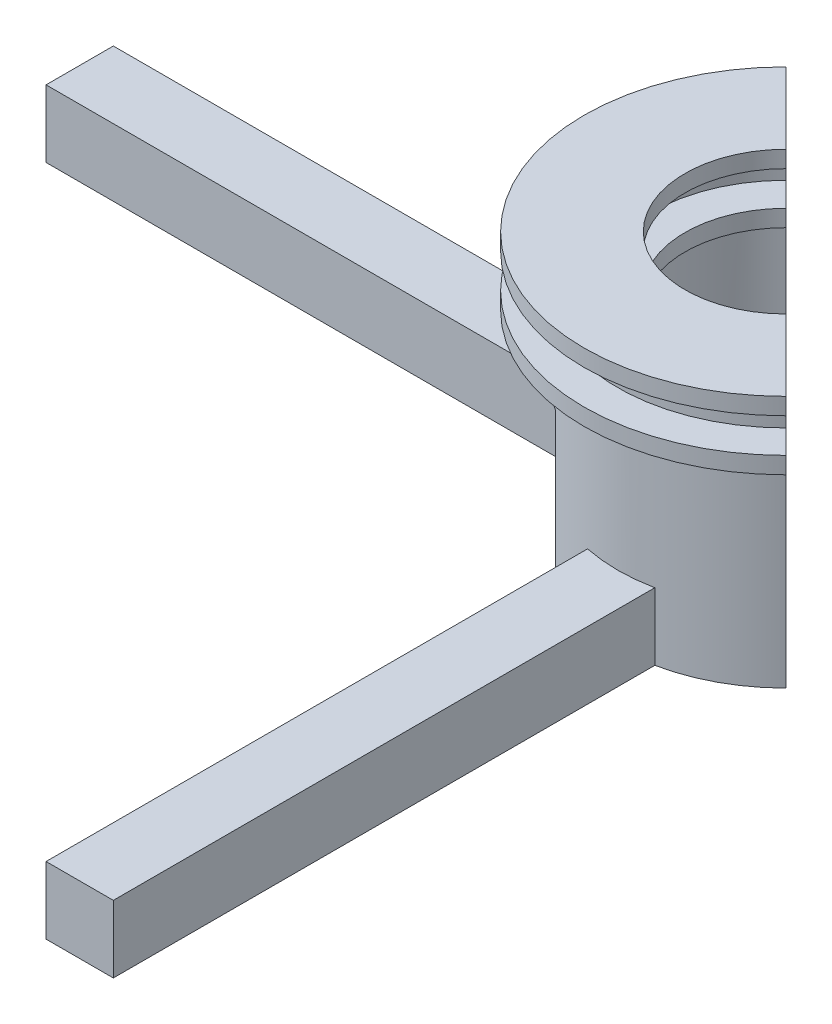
from build123d import *

# Parameters (mm, degrees)
SKETCH1_W           = 5
SKETCH1_H           = 2.5
BOSS_EXTRUDE1_START = -0.505103
BOSS_EXTRUDE1_DEPTH = 80.505103
CIRPATTERN1_COUNT   = 4
CUT_EXTRUDE1_DEPTH  = 179.294226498
BOSS_EXTRUDE3_START = -45
BOSS_EXTRUDE3_DEPTH = 45
CUT_EXTRUDE3_START  = -15
CUT_EXTRUDE3_DEPTH  = 15
CUT_EXTRUDE4_DEPTH  = 31
SKETCH12_W          = 170.445018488
SKETCH12_H          = 107.374208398
CUT_EXTRUDE5_DEPTH  = 155.075338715


with BuildPart() as part:
    # Sketch1 → Revolve1 (revolve)
    with BuildSketch(Plane.XY, mode=Mode.PRIVATE) as revolve1_sk:
        Polygon((-20, -41.1), (-25, -41.1), (-25, 0), (-15, 0), (-15, -2.5), (-20.1, -2.5), (-20.1, -7.6), (-15, -7.6), (-15, -10.1), (-20, -10.1), align=None)
        with Locations((-27.5, -8.85)):
            Rectangle(SKETCH1_W, SKETCH1_H)
        with Locations((-27.5, -1.25)):
            Rectangle(SKETCH1_W, SKETCH1_H)
    revolve(revolve1_sk.sketch.rotate(Axis((0, 0, 0), (0, -1, 0)), 270), axis=Axis((0, 0, 0), (0, -1, 0)))

    # Sketch2 → Boss-Extrude1 (add)
    with BuildSketch(Plane.XY.offset(25).offset(BOSS_EXTRUDE1_START)):
        Polygon((0, -41.1), (-5, -41.1), (-5, -31.1), (5, -31.1), (5, -41.1), align=None)
    boss_extrude1 = extrude(amount=BOSS_EXTRUDE1_DEPTH)

    # CirPattern1: Boss-Extrude1 ×4 about axis
    cirpattern1_axis = Axis((0, 0, 0), (0, 1, 0))
    for i in range(1, CIRPATTERN1_COUNT):
        add(boss_extrude1.rotate(cirpattern1_axis, i * 360 / CIRPATTERN1_COUNT))

    # Sketch3 → Cut-Extrude1 (cut, through all)
    with BuildSketch(Plane(origin=(-17.67766953, 0, 17.67766953), x_dir=(0, 1, 0), z_dir=(-0.7071067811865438, 0, 0.7071067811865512))):
        Polygon((-41.1, 0), (-41.1, 6.15), (-18.6, 6.15), (-18.6, -6.15), (-41.1, -6.15), align=None)
    extrude(amount=-CUT_EXTRUDE1_DEPTH, mode=Mode.SUBTRACT)

    # Sketch4 → Boss-Extrude3 (add)
    with BuildSketch(Plane(origin=(17.67766953, 0, 17.67766953), x_dir=(0, 1, 0), z_dir=(0.7071067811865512, 0, 0.7071067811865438)).offset(BOSS_EXTRUDE3_START)):
        Polygon((-41.1, 0), (-41.1, 7.5), (-26.1, 7.5), (-26.1, -7.5), (-41.1, -7.5), align=None)
    extrude(amount=BOSS_EXTRUDE3_DEPTH)

    # Sketch10 → Cut-Extrude3 (cut)
    with BuildSketch(Plane.XZ.offset(41.1).offset(CUT_EXTRUDE3_START)):
        with BuildLine():
            ThreePointArc((11.560121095, 22.166722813), (14.790199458, 20.155644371), (17.67766953, 17.67766953))
            Line((17.67766953, 17.67766953), (12.374368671, 22.980970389))
            Line((12.374368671, 22.980970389), (11.560121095, 22.166722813))
        make_face()
        with BuildLine():
            ThreePointArc((17.67766953, 17.67766953), (20.155644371, 14.790199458), (22.166722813, 11.560121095))
            Line((22.166722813, 11.560121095), (22.980970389, 12.374368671))
            Line((22.980970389, 12.374368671), (17.67766953, 17.67766953))
        make_face()
    extrude(amount=CUT_EXTRUDE3_DEPTH, mode=Mode.SUBTRACT)

    # Sketch11 → Cut-Extrude4 (cut)
    with BuildSketch(Plane.XZ.offset(41.1)):
        Polygon((-17.805628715, 9.108215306), (9.108215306, -17.805628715), (17.805628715, -9.108215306), (-9.108215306, 17.805628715), align=None)
    extrude(amount=-CUT_EXTRUDE4_DEPTH, mode=Mode.SUBTRACT)

    # Sketch12 → Cut-Extrude5 (cut, through all)
    with BuildSketch(Plane(origin=(0, 0, 0), x_dir=(0.7071067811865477, 0, 0.7071067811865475), z_dir=(-0.7071067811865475, 0, 0.7071067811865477))):
        with Locations((-1.384481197, -1.384481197)):
            Rectangle(SKETCH12_W, SKETCH12_H)
    extrude(amount=-CUT_EXTRUDE5_DEPTH, mode=Mode.SUBTRACT)


solid = part.part
